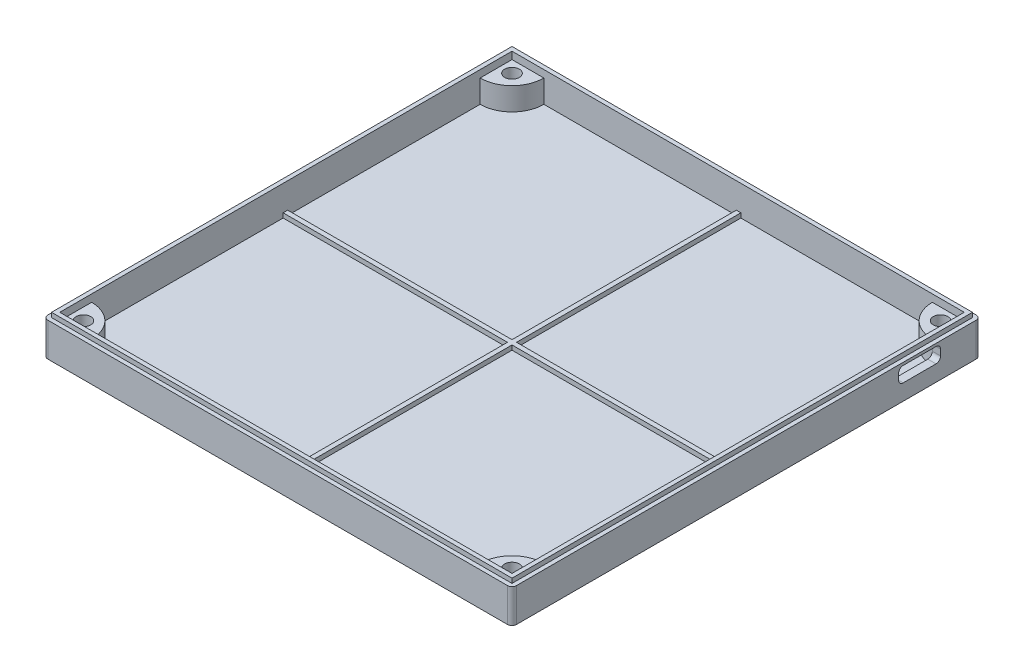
from build123d import *

# Parameters (mm, degrees)
SKETCH_1_W                      = 102.8
SKETCH_1_H                      = 102.8
EXTRUDE_1_DEPTH                 = 8
SKETCH_2_W                      = 99.2
SKETCH_2_H                      = 99.2
CUT_EXTRUDE_1_DEPTH             = 6.6
EXTRUDE_7_DEPTH                 = 1
SKETCH_14_W                     = 102.8
SKETCH_14_H                     = 102.8
EXTRUDE_9_DEPTH                 = 0.4
SKETCH_17_R                     = 1.6
EXTRUDE_10_DEPTH                = 5
CUT_EXTRUDE_6_DEPTH             = 2.5
CUT_EXTRUDE_7_REACH             = 147.601
CUT_EXTRUDE_7_DIRECTION_2_DEPTH = 146.601098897
SKETCH_22_W                     = 102.8
SKETCH_22_H                     = 102.8
SKETCH_22_W_2                   = 101
SKETCH_22_H_2                   = 101
CUT_EXTRUDE_9_DEPTH             = 1
FILLET_1_R                      = 1
MIRROR_2_COPY_1_SKETCH_R        = 1.6
MIRROR_2_COPY_1_DEPTH           = 5
MIRROR_2_COPY_2_DEPTH           = 2.5


with BuildPart() as part:
    # Sketch 1 → Extrude 1 (new body)
    with BuildSketch(Plane(origin=(0, 0, 0), x_dir=(1, 0, 0), z_dir=(0, 1, 0))):
        with Locations((51.4, -51.4)):
            Rectangle(SKETCH_1_W, SKETCH_1_H)
    extrude(amount=EXTRUDE_1_DEPTH)

    # Sketch 2 → Cut-Extrude 1 (cut)
    with BuildSketch(Plane(origin=(0, 8, 0), x_dir=(1, 0, 0), z_dir=(0, 1, 0))):
        with Locations((51.4, -51.4)):
            Rectangle(SKETCH_2_W, SKETCH_2_H)
    extrude(amount=-CUT_EXTRUDE_1_DEPTH, mode=Mode.SUBTRACT)

    # Sketch 10 → Extrude 7 (add)
    with BuildSketch(Plane(origin=(0, 1.4, 0), x_dir=(1, 0, 0), z_dir=(0, 1, 0))):
        Polygon((51, -1.8), (52, -1.8), (52, -51), (101, -51), (101, -52), (52, -52), (52, -101), (51, -101), (51, -52), (1.8, -52), (1.8, -51), (51, -51), align=None)
    extrude(amount=EXTRUDE_7_DEPTH)

    # Sketch 14 → Extrude 9 (add)
    with BuildSketch(Plane.XZ):
        with Locations((51.4, 51.4)):
            Rectangle(SKETCH_14_W, SKETCH_14_H)
    extrude(amount=EXTRUDE_9_DEPTH)

    # Sketch 17 → Extrude 10 (add)
    with BuildSketch(Plane(origin=(0, 1.4, 0), x_dir=(1, 0, 0), z_dir=(0, 1, 0))):
        with BuildLine():
            Line((1.8, -1.8), (1.8, -8.8))
            ThreePointArc((1.8, -8.8), (6.749747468, -6.749747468), (8.8, -1.8))
            Line((8.8, -1.8), (1.8, -1.8))
        make_face()
        with Locations(Location((4.4, -4.4, 0), (0, 0, 270))):
            Circle(SKETCH_17_R, mode=Mode.SUBTRACT)
    extrude_10 = extrude(amount=EXTRUDE_10_DEPTH)

    # Sketch 18 → Cut-Extrude 6 (cut)
    with BuildSketch(Plane.XZ.offset(0.4)):
        Polygon((1.653314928, 5.993441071), (1.646697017, 2.818021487), (4.393382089, 1.224580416), (7.146685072, 2.806558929), (7.153302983, 5.981978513), (4.406617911, 7.575419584), align=None)
    cut_extrude_6 = extrude(amount=-CUT_EXTRUDE_6_DEPTH, mode=Mode.SUBTRACT)

    # Mirror 1: Extrude 10, Cut-Extrude 6 across plane
    add(extrude_10.mirror(Plane(origin=(51.4, 0, 0), x_dir=(0, 0, 1), z_dir=(1, 0, 0))))
    add(cut_extrude_6.mirror(Plane(origin=(51.4, 0, 0), x_dir=(0, 0, 1), z_dir=(1, 0, 0))), mode=Mode.SUBTRACT)

    # Sketch 21 → Cut-Extrude 7 (cut, up to next)
    with BuildSketch(Plane(origin=(102.8, 0, 0), x_dir=(0, 0, -1), z_dir=(1, 0, 0)), mode=Mode.PRIVATE) as cut_extrude_7_sk1:
        with BuildLine():
            Line((-9.8, 6.4), (-17, 6.4))
            ThreePointArc((-17, 6.4), (-17.707106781, 6.107106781), (-18, 5.4))
            Line((-18, 5.4), (-18, 4.1))
            ThreePointArc((-18, 4.1), (-17.707106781, 3.392893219), (-17, 3.1))
            Line((-17, 3.1), (-9.8, 3.1))
            ThreePointArc((-9.8, 3.1), (-9.092893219, 3.392893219), (-8.8, 4.1))
            Line((-8.8, 4.1), (-8.8, 5.4))
            ThreePointArc((-8.8, 5.4), (-9.092893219, 6.107106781), (-9.8, 6.4))
        make_face()
    cut_extrude_7_tool1 = extrude(cut_extrude_7_sk1.sketch, amount=-CUT_EXTRUDE_7_REACH, mode=Mode.PRIVATE) & part.part
    add(cut_extrude_7_tool1.solids().sort_by_distance((102.8, 4.75, 13.4))[0], mode=Mode.SUBTRACT)

    # Sketch 21 → Cut-Extrude 7 direction 2 (cut)
    with BuildSketch(Plane(origin=(102.8, 0, 0), x_dir=(0, 0, -1), z_dir=(1, 0, 0))):
        with BuildLine():
            Line((-9.8, 6.4), (-17, 6.4))
            ThreePointArc((-17, 6.4), (-17.707106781, 6.107106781), (-18, 5.4))
            Line((-18, 5.4), (-18, 4.1))
            ThreePointArc((-18, 4.1), (-17.707106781, 3.392893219), (-17, 3.1))
            Line((-17, 3.1), (-9.8, 3.1))
            ThreePointArc((-9.8, 3.1), (-9.092893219, 3.392893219), (-8.8, 4.1))
            Line((-8.8, 4.1), (-8.8, 5.4))
            ThreePointArc((-8.8, 5.4), (-9.092893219, 6.107106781), (-9.8, 6.4))
        make_face()
    extrude(amount=CUT_EXTRUDE_7_DIRECTION_2_DEPTH, mode=Mode.SUBTRACT)

    # Sketch 22 → Cut-Extrude 9 (cut)
    with BuildSketch(Plane(origin=(0, 8, 0), x_dir=(1, 0, 0), z_dir=(0, 1, 0))):
        with Locations((51.4, -51.4)):
            Rectangle(SKETCH_22_W, SKETCH_22_H)
        with Locations((51.4, -51.4)):
            Rectangle(SKETCH_22_W_2, SKETCH_22_H_2, mode=Mode.SUBTRACT)
    extrude(amount=-CUT_EXTRUDE_9_DEPTH, mode=Mode.SUBTRACT)

    # Fillet 1
    fillet_1_edges = [part.edges().sort_by_distance(p)[0] for p in [
        (102.8, 3.3, 0),
        (0, 3.3, 0),
        (102.8, 3.3, 102.8),
        (0, 3.3, 102.8),
    ]]
    fillet(fillet_1_edges, radius=FILLET_1_R)

    # Mirror 2: Extrude 10, Cut-Extrude 6 across plane
    add(extrude_10.mirror(Plane(origin=(0, 0, 51.4), x_dir=(1, 0, 0), z_dir=(0, 0, -1))))
    add(cut_extrude_6.mirror(Plane(origin=(0, 0, 51.4), x_dir=(1, 0, 0), z_dir=(0, 0, -1))), mode=Mode.SUBTRACT)

    # Mirror 2 copy 1 sketch → Mirror 2 copy 1 (add)
    with BuildSketch(Plane(origin=(102.8, 1.4, 102.8), x_dir=(-1, 0, 0), z_dir=(0, 1, 0))):
        with BuildLine():
            Line((1.8, -1.8), (1.8, -8.8))
            ThreePointArc((1.8, -8.8), (6.749747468, -6.749747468), (8.8, -1.8))
            Line((8.8, -1.8), (1.8, -1.8))
        make_face()
        with Locations(Location((4.4, -4.4, 0), (0, 0, 270))):
            Circle(MIRROR_2_COPY_1_SKETCH_R, mode=Mode.SUBTRACT)
    extrude(amount=MIRROR_2_COPY_1_DEPTH)

    # Mirror 2 copy 2 sketch → Mirror 2 copy 2 (cut)
    with BuildSketch(Plane(origin=(102.8, -0.4, 102.8), x_dir=(-1, 0, 0), z_dir=(0, -1, 0))):
        Polygon((1.653314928, 5.993441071), (1.646697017, 2.818021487), (4.393382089, 1.224580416), (7.146685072, 2.806558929), (7.153302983, 5.981978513), (4.406617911, 7.575419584), align=None)
    extrude(amount=-MIRROR_2_COPY_2_DEPTH, mode=Mode.SUBTRACT)


solid = part.part
